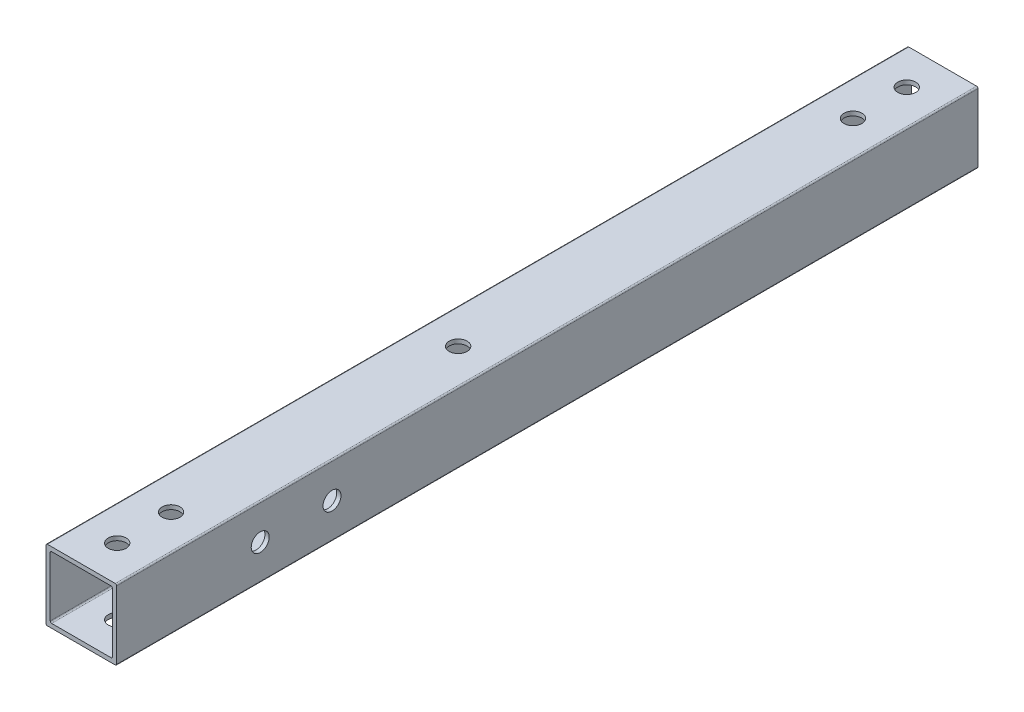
from build123d import *

# Parameters (mm, degrees)
BOSS_EXTRUDE1_DEPTH = 304.8
CUT_EXTRUDE1_REACH  = 2002.195
SKETCH2_R           = 3.175
CUT_EXTRUDE2_REACH  = 2002.195
SKETCH3_R           = 3.175
CUT_EXTRUDE3_REACH  = 2002.195
SKETCH4_R           = 3.175


with BuildPart() as part:
    # Sketch1 → Boss-Extrude1 (new body)
    with BuildSketch(Plane(origin=(0, 0, -2000), x_dir=(-1, 0, 0), z_dir=(0, 0, -1))):
        with BuildLine():
            Line((12.5, -12), (12.5, 12))
            ThreePointArc((12.5, 12), (12.353553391, 12.353553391), (12, 12.5))
            Line((12, 12.5), (-12, 12.5))
            ThreePointArc((-12, 12.5), (-12.353553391, 12.353553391), (-12.5, 12))
            Line((-12.5, 12), (-12.5, -12))
            ThreePointArc((-12.5, -12), (-12.353553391, -12.353553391), (-12, -12.5))
            Line((-12, -12.5), (12, -12.5))
            ThreePointArc((12, -12.5), (12.353553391, -12.353553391), (12.5, -12))
        make_face()
        with BuildLine():
            Line((11, 10.5), (11, -10.5))
            ThreePointArc((11, -10.5), (10.853553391, -10.853553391), (10.5, -11))
            Line((10.5, -11), (-10.5, -11))
            ThreePointArc((-10.5, -11), (-10.853553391, -10.853553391), (-11, -10.5))
            Line((-11, -10.5), (-11, 10.5))
            ThreePointArc((-11, 10.5), (-10.853553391, 10.853553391), (-10.5, 11))
            Line((-10.5, 11), (10.5, 11))
            ThreePointArc((10.5, 11), (10.853553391, 10.853553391), (11, 10.5))
        make_face(mode=Mode.SUBTRACT)
    extrude(amount=-BOSS_EXTRUDE1_DEPTH)

    # Cut-Extrude1: up to this face of the body (flat: up to its plane)
    cut_extrude1_end = Plane(part.part.faces().sort_by_distance((0, -12.5, -1847.6))[0])
    # Sketch2 → Cut-Extrude1 (cut, up to the picked face)
    with BuildSketch(Plane(origin=(0, 12.5, 0), x_dir=(1, 0, 0), z_dir=(0, 1, 0)), mode=Mode.PRIVATE) as cut_extrude1_sk1:
        with Locations(Location((0, 1987.3, 0), (0, 0, 180))):
            Circle(SKETCH2_R)
    cut_extrude1_tool1 = split(extrude(cut_extrude1_sk1.sketch, amount=-CUT_EXTRUDE1_REACH, mode=Mode.PRIVATE), bisect_by=cut_extrude1_end, keep=Keep.BOTH, mode=Mode.PRIVATE)
    # Sketch2 → Cut-Extrude1 (cut, up to the picked face)
    with BuildSketch(Plane(origin=(0, 12.5, 0), x_dir=(1, 0, 0), z_dir=(0, 1, 0)), mode=Mode.PRIVATE) as cut_extrude1_sk2:
        with Locations(Location((0, 1968.25, 0), (0, 0, 180))):
            Circle(SKETCH2_R)
    cut_extrude1_tool2 = split(extrude(cut_extrude1_sk2.sketch, amount=-CUT_EXTRUDE1_REACH, mode=Mode.PRIVATE), bisect_by=cut_extrude1_end, keep=Keep.BOTH, mode=Mode.PRIVATE)
    # Sketch2 → Cut-Extrude1 (cut, up to the picked face)
    with BuildSketch(Plane(origin=(0, 12.5, 0), x_dir=(1, 0, 0), z_dir=(0, 1, 0)), mode=Mode.PRIVATE) as cut_extrude1_sk3:
        with Locations(Location((0, 1707.9, 0), (0, 0, 180))):
            Circle(SKETCH2_R)
    cut_extrude1_tool3 = split(extrude(cut_extrude1_sk3.sketch, amount=-CUT_EXTRUDE1_REACH, mode=Mode.PRIVATE), bisect_by=cut_extrude1_end, keep=Keep.BOTH, mode=Mode.PRIVATE)
    # Sketch2 → Cut-Extrude1 (cut, up to the picked face)
    with BuildSketch(Plane(origin=(0, 12.5, 0), x_dir=(1, 0, 0), z_dir=(0, 1, 0)), mode=Mode.PRIVATE) as cut_extrude1_sk4:
        with Locations(Location((0, 1726.95, 0), (0, 0, 180))):
            Circle(SKETCH2_R)
    cut_extrude1_tool4 = split(extrude(cut_extrude1_sk4.sketch, amount=-CUT_EXTRUDE1_REACH, mode=Mode.PRIVATE), bisect_by=cut_extrude1_end, keep=Keep.BOTH, mode=Mode.PRIVATE)
    add(cut_extrude1_tool1.solids().sort_by(Axis((0, 12.5, -1987.3), (0, -1, 0)))[0], mode=Mode.SUBTRACT)
    add(cut_extrude1_tool2.solids().sort_by(Axis((0, 12.5, -1968.25), (0, -1, 0)))[0], mode=Mode.SUBTRACT)
    add(cut_extrude1_tool3.solids().sort_by(Axis((0, 12.5, -1707.9), (0, -1, 0)))[0], mode=Mode.SUBTRACT)
    add(cut_extrude1_tool4.solids().sort_by(Axis((0, 12.5, -1726.95), (0, -1, 0)))[0], mode=Mode.SUBTRACT)

    # Cut-Extrude2: up to this face of the body (flat: up to its plane)
    cut_extrude2_end = Plane(part.part.faces().sort_by_distance((-12.5, 0, -1847.6))[0])
    # Sketch3 → Cut-Extrude2 (cut, up to the picked face)
    with BuildSketch(Plane(origin=(12.5, 0, 0), x_dir=(0, 0, -1), z_dir=(1, 0, 0)), mode=Mode.PRIVATE) as cut_extrude2_sk1:
        with Locations(Location((1771.4, 0, 0), (0, 0, 90))):
            Circle(SKETCH3_R)
    cut_extrude2_tool1 = split(extrude(cut_extrude2_sk1.sketch, amount=-CUT_EXTRUDE2_REACH, mode=Mode.PRIVATE), bisect_by=cut_extrude2_end, keep=Keep.BOTH, mode=Mode.PRIVATE)
    # Sketch3 → Cut-Extrude2 (cut, up to the picked face)
    with BuildSketch(Plane(origin=(12.5, 0, 0), x_dir=(0, 0, -1), z_dir=(1, 0, 0)), mode=Mode.PRIVATE) as cut_extrude2_sk2:
        with Locations(Location((1746, 0, 0), (0, 0, 90))):
            Circle(SKETCH3_R)
    cut_extrude2_tool2 = split(extrude(cut_extrude2_sk2.sketch, amount=-CUT_EXTRUDE2_REACH, mode=Mode.PRIVATE), bisect_by=cut_extrude2_end, keep=Keep.BOTH, mode=Mode.PRIVATE)
    add(cut_extrude2_tool1.solids().sort_by(Axis((12.5, 0, -1771.4), (-1, 0, 0)))[0], mode=Mode.SUBTRACT)
    add(cut_extrude2_tool2.solids().sort_by(Axis((12.5, 0, -1746), (-1, 0, 0)))[0], mode=Mode.SUBTRACT)

    # Cut-Extrude3: up to this face of the body (flat: up to its plane)
    cut_extrude3_end = Plane(part.part.faces().sort_by_distance((0, -12.5, -1847.6))[0])
    # Sketch4 → Cut-Extrude3 (cut, up to the picked face)
    with BuildSketch(Plane(origin=(0, 12.5, 0), x_dir=(1, 0, 0), z_dir=(0, 1, 0)), mode=Mode.PRIVATE) as cut_extrude3_sk1:
        with Locations(Location((0, 1828.55, 0), (0, 0, 180))):
            Circle(SKETCH4_R)
    cut_extrude3_tool1 = split(extrude(cut_extrude3_sk1.sketch, amount=-CUT_EXTRUDE3_REACH, mode=Mode.PRIVATE), bisect_by=cut_extrude3_end, keep=Keep.BOTH, mode=Mode.PRIVATE)
    add(cut_extrude3_tool1.solids().sort_by(Axis((0, 12.5, -1828.55), (0, -1, 0)))[0], mode=Mode.SUBTRACT)


solid = part.part
